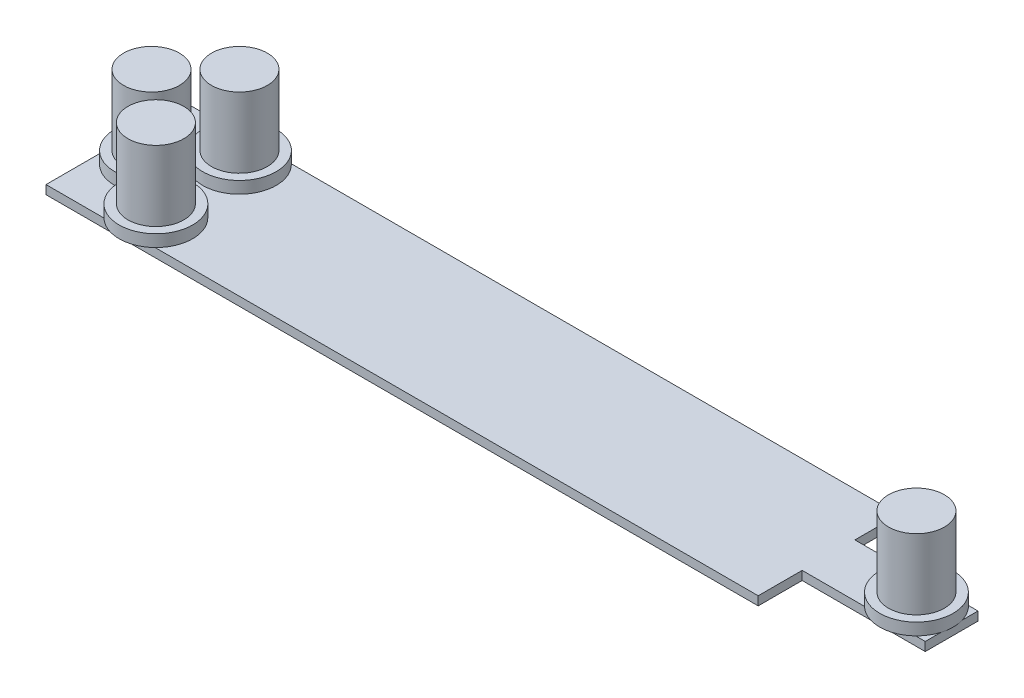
ISO-10303-21;
HEADER;
FILE_DESCRIPTION(('STEP AP214'),'2;1');
FILE_NAME('part.step','',(''),(''),'','','');
FILE_SCHEMA(('AUTOMOTIVE_DESIGN { 1 0 10303 214 1 1 1 1 }'));
ENDSEC;
DATA;
#1=APPLICATION_CONTEXT('core data for automotive mechanical design processes');
#2=APPLICATION_PROTOCOL_DEFINITION('international standard','automotive_design',2000,#1);
#3=PRODUCT_CONTEXT('',#1,'mechanical');
#4=PRODUCT('Part','Part','',(#3));
#5=PRODUCT_RELATED_PRODUCT_CATEGORY('part','',(#4));
#6=PRODUCT_DEFINITION_FORMATION('','',#4);
#7=PRODUCT_DEFINITION_CONTEXT('part definition',#1,'design');
#8=PRODUCT_DEFINITION('design','',#6,#7);
#9=PRODUCT_DEFINITION_SHAPE('','',#8);
#10=(LENGTH_UNIT() NAMED_UNIT(*) SI_UNIT(.MILLI.,.METRE.));
#11=(NAMED_UNIT(*) PLANE_ANGLE_UNIT() SI_UNIT($,.RADIAN.));
#12=(NAMED_UNIT(*) SI_UNIT($,.STERADIAN.) SOLID_ANGLE_UNIT());
#13=UNCERTAINTY_MEASURE_WITH_UNIT(LENGTH_MEASURE(1.E-05),#10,'distance_accuracy_value','');
#14=(GEOMETRIC_REPRESENTATION_CONTEXT(3) GLOBAL_UNCERTAINTY_ASSIGNED_CONTEXT((#13)) GLOBAL_UNIT_ASSIGNED_CONTEXT((#10,
#11,#12)) REPRESENTATION_CONTEXT('',''));
#15=CARTESIAN_POINT('',(0.,0.,0.));
#16=DIRECTION('',(0.,0.,1.));
#17=DIRECTION('',(1.,0.,0.));
#18=AXIS2_PLACEMENT_3D('',#15,#16,#17);
#19=CARTESIAN_POINT('',(43.5,2.36,0.));
#20=DIRECTION('',(0.,1.,0.));
#21=DIRECTION('',(0.,0.,1.));
#22=AXIS2_PLACEMENT_3D('',#19,#20,#21);
#23=PLANE('',#22);
#24=CARTESIAN_POINT('',(43.5,2.36,0.));
#25=DIRECTION('',(0.,1.,0.));
#26=DIRECTION('',(0.,0.,1.));
#27=AXIS2_PLACEMENT_3D('',#24,#25,#26);
#28=CIRCLE('',#27,4.18);
#29=CARTESIAN_POINT('',(43.5,2.36,4.18));
#30=VERTEX_POINT('',#29);
#31=EDGE_CURVE('E220',#30,#30,#28,.T.);
#32=ORIENTED_EDGE('',*,*,#31,.T.);
#33=EDGE_LOOP('',(#32));
#34=FACE_BOUND('',#33,.T.);
#35=CARTESIAN_POINT('',(43.5,2.36,0.));
#36=DIRECTION('',(0.,1.,0.));
#37=DIRECTION('',(0.,0.,1.));
#38=AXIS2_PLACEMENT_3D('',#35,#36,#37);
#39=CIRCLE('',#38,3.18);
#40=CARTESIAN_POINT('',(43.5,2.36,3.18));
#41=VERTEX_POINT('',#40);
#42=EDGE_CURVE('E637',#41,#41,#39,.T.);
#43=ORIENTED_EDGE('',*,*,#42,.F.);
#44=EDGE_LOOP('',(#43));
#45=FACE_BOUND('',#44,.T.);
#46=ADVANCED_FACE('F33',(#34,#45),#23,.T.);
#47=CARTESIAN_POINT('',(-38.,2.36,5.));
#48=DIRECTION('',(0.,1.,0.));
#49=DIRECTION('',(0.,0.,1.));
#50=AXIS2_PLACEMENT_3D('',#47,#48,#49);
#51=PLANE('',#50);
#52=CARTESIAN_POINT('',(-38.,2.36,5.));
#53=DIRECTION('',(0.,1.,0.));
#54=DIRECTION('',(0.,0.,1.));
#55=AXIS2_PLACEMENT_3D('',#52,#53,#54);
#56=CIRCLE('',#55,4.18);
#57=CARTESIAN_POINT('',(-38.,2.36,9.18));
#58=VERTEX_POINT('',#57);
#59=EDGE_CURVE('E234',#58,#58,#56,.T.);
#60=ORIENTED_EDGE('',*,*,#59,.T.);
#61=EDGE_LOOP('',(#60));
#62=FACE_BOUND('',#61,.T.);
#63=CARTESIAN_POINT('',(-38.,2.36,5.));
#64=DIRECTION('',(0.,1.,0.));
#65=DIRECTION('',(0.,0.,1.));
#66=AXIS2_PLACEMENT_3D('',#63,#64,#65);
#67=CIRCLE('',#66,3.18);
#68=CARTESIAN_POINT('',(-38.,2.36,8.18));
#69=VERTEX_POINT('',#68);
#70=EDGE_CURVE('E636',#69,#69,#67,.T.);
#71=ORIENTED_EDGE('',*,*,#70,.F.);
#72=EDGE_LOOP('',(#71));
#73=FACE_BOUND('',#72,.T.);
#74=ADVANCED_FACE('F403',(#62,#73),#51,.T.);
#75=CARTESIAN_POINT('',(-43.5,2.36,0.));
#76=DIRECTION('',(0.,1.,0.));
#77=DIRECTION('',(0.,0.,1.));
#78=AXIS2_PLACEMENT_3D('',#75,#76,#77);
#79=PLANE('',#78);
#80=CARTESIAN_POINT('',(-43.5,2.36,0.));
#81=DIRECTION('',(0.,1.,0.));
#82=DIRECTION('',(0.,0.,1.));
#83=AXIS2_PLACEMENT_3D('',#80,#81,#82);
#84=CIRCLE('',#83,3.18);
#85=CARTESIAN_POINT('',(-40.4514752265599,2.36,0.904929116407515));
#86=VERTEX_POINT('',#85);
#87=CARTESIAN_POINT('',(-40.358666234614,2.36,-0.494390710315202));
#88=VERTEX_POINT('',#87);
#89=EDGE_CURVE('E208',#86,#88,#84,.T.);
#90=ORIENTED_EDGE('',*,*,#89,.F.);
#91=DIRECTION('',(0.547787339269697,0.,-0.8366176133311));
#92=VECTOR('',#91,1.);
#93=CARTESIAN_POINT('',(-42.519515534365,2.36,4.06337916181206));
#94=LINE('',#93,#92);
#95=CARTESIAN_POINT('',(-40.3182491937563,2.36,0.701457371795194));
#96=VERTEX_POINT('',#95);
#97=EDGE_CURVE('E184',#86,#96,#94,.T.);
#98=ORIENTED_EDGE('',*,*,#97,.T.);
#99=DIRECTION('',(0.,0.,-1.));
#100=VECTOR('',#99,1.);
#101=CARTESIAN_POINT('',(-40.3182491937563,2.36,0.701457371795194));
#102=LINE('',#101,#100);
#103=CARTESIAN_POINT('',(-40.3182491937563,2.36,-0.44348631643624));
#104=VERTEX_POINT('',#103);
#105=EDGE_CURVE('E183',#96,#104,#102,.T.);
#106=ORIENTED_EDGE('',*,*,#105,.T.);
#107=DIRECTION('',(-0.621815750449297,0.,-0.783163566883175));
#108=VECTOR('',#107,1.);
#109=CARTESIAN_POINT('',(-40.3182491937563,2.36,-0.44348631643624));
#110=LINE('',#109,#108);
#111=EDGE_CURVE('E251',#104,#88,#110,.T.);
#112=ORIENTED_EDGE('',*,*,#111,.T.);
#113=EDGE_LOOP('',(#90,#98,#106,#112));
#114=FACE_BOUND('',#113,.T.);
#115=ADVANCED_FACE('F409',(#114),#79,.T.);
#116=CARTESIAN_POINT('',(-38.5,2.36,-5.));
#117=DIRECTION('',(0.,1.,0.));
#118=DIRECTION('',(0.,0.,1.));
#119=AXIS2_PLACEMENT_3D('',#116,#117,#118);
#120=PLANE('',#119);
#121=CARTESIAN_POINT('',(-38.5,2.36,-5.));
#122=DIRECTION('',(0.,1.,0.));
#123=DIRECTION('',(0.,0.,1.));
#124=AXIS2_PLACEMENT_3D('',#121,#122,#123);
#125=CIRCLE('',#124,3.18);
#126=CARTESIAN_POINT('',(-38.5,2.36,-1.82));
#127=VERTEX_POINT('',#126);
#128=EDGE_CURVE('E195',#127,#127,#125,.T.);
#129=ORIENTED_EDGE('',*,*,#128,.F.);
#130=EDGE_LOOP('',(#129));
#131=FACE_BOUND('',#130,.T.);
#132=CARTESIAN_POINT('',(-38.5,2.36,-5.));
#133=DIRECTION('',(0.,1.,0.));
#134=DIRECTION('',(0.,0.,1.));
#135=AXIS2_PLACEMENT_3D('',#132,#133,#134);
#136=CIRCLE('',#135,4.18);
#137=CARTESIAN_POINT('',(-40.6533140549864,2.36,-1.41731405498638));
#138=VERTEX_POINT('',#137);
#139=CARTESIAN_POINT('',(-42.0826859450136,2.36,-2.84668594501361));
#140=VERTEX_POINT('',#139);
#141=EDGE_CURVE('E245',#138,#140,#136,.T.);
#142=ORIENTED_EDGE('',*,*,#141,.T.);
#143=EDGE_CURVE('E654',#138,#140,#84,.T.);
#144=ORIENTED_EDGE('',*,*,#143,.F.);
#145=EDGE_LOOP('',(#142,#144));
#146=FACE_BOUND('',#145,.T.);
#147=ADVANCED_FACE('F489',(#131,#146),#120,.T.);
#148=CARTESIAN_POINT('',(0.,1.,0.));
#149=DIRECTION('',(0.,1.,0.));
#150=DIRECTION('',(0.,0.,1.));
#151=AXIS2_PLACEMENT_3D('',#148,#149,#150);
#152=PLANE('',#151);
#153=DIRECTION('',(1.,0.,0.));
#154=VECTOR('',#153,1.);
#155=CARTESIAN_POINT('',(47.5,1.,2.99999999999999));
#156=LINE('',#155,#154);
#157=CARTESIAN_POINT('',(33.5,1.,2.99999999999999));
#158=VERTEX_POINT('',#157);
#159=CARTESIAN_POINT('',(40.5892612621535,1.,2.99999999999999));
#160=VERTEX_POINT('',#159);
#161=EDGE_CURVE('E288',#158,#160,#156,.T.);
#162=ORIENTED_EDGE('',*,*,#161,.T.);
#163=CARTESIAN_POINT('',(43.5,1.,0.));
#164=DIRECTION('',(0.,1.,0.));
#165=DIRECTION('',(0.,0.,1.));
#166=AXIS2_PLACEMENT_3D('',#163,#164,#165);
#167=CIRCLE('',#166,4.18);
#168=CARTESIAN_POINT('',(40.5892612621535,1.,-3.00000000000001));
#169=VERTEX_POINT('',#168);
#170=EDGE_CURVE('E441',#169,#160,#167,.T.);
#171=ORIENTED_EDGE('',*,*,#170,.F.);
#172=DIRECTION('',(-1.,0.,0.));
#173=VECTOR('',#172,1.);
#174=CARTESIAN_POINT('',(47.5,1.,-3.00000000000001));
#175=LINE('',#174,#173);
#176=CARTESIAN_POINT('',(33.5,1.,-3.00000000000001));
#177=VERTEX_POINT('',#176);
#178=EDGE_CURVE('E295',#169,#177,#175,.T.);
#179=ORIENTED_EDGE('',*,*,#178,.T.);
#180=DIRECTION('',(0.,0.,-1.));
#181=VECTOR('',#180,1.);
#182=CARTESIAN_POINT('',(33.5,1.,-3.00000000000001));
#183=LINE('',#182,#181);
#184=CARTESIAN_POINT('',(33.5,1.,-8.00000000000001));
#185=VERTEX_POINT('',#184);
#186=EDGE_CURVE('E299',#177,#185,#183,.T.);
#187=ORIENTED_EDGE('',*,*,#186,.T.);
#188=DIRECTION('',(-1.,0.,0.));
#189=VECTOR('',#188,1.);
#190=CARTESIAN_POINT('',(33.5,1.,-8.00000000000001));
#191=LINE('',#190,#189);
#192=CARTESIAN_POINT('',(-35.5892612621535,1.,-7.99999999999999));
#193=VERTEX_POINT('',#192);
#194=EDGE_CURVE('E303',#185,#193,#191,.T.);
#195=ORIENTED_EDGE('',*,*,#194,.T.);
#196=CARTESIAN_POINT('',(-38.5,1.,-5.));
#197=DIRECTION('',(0.,1.,0.));
#198=DIRECTION('',(0.,0.,1.));
#199=AXIS2_PLACEMENT_3D('',#196,#197,#198);
#200=CIRCLE('',#199,4.18);
#201=CARTESIAN_POINT('',(-41.4107387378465,1.,-8.));
#202=VERTEX_POINT('',#201);
#203=EDGE_CURVE('E11',#193,#202,#200,.F.);
#204=ORIENTED_EDGE('',*,*,#203,.T.);
#205=CARTESIAN_POINT('',(-47.5,1.,-8.));
#206=VERTEX_POINT('',#205);
#207=EDGE_CURVE('E302',#202,#206,#191,.T.);
#208=ORIENTED_EDGE('',*,*,#207,.T.);
#209=DIRECTION('',(0.,0.,1.));
#210=VECTOR('',#209,1.);
#211=CARTESIAN_POINT('',(-47.5,1.,8.));
#212=LINE('',#211,#210);
#213=CARTESIAN_POINT('',(-47.5,1.,-1.21342490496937));
#214=VERTEX_POINT('',#213);
#215=EDGE_CURVE('E275',#206,#214,#212,.T.);
#216=ORIENTED_EDGE('',*,*,#215,.T.);
#217=CARTESIAN_POINT('',(-43.5,1.,0.));
#218=DIRECTION('',(0.,1.,0.));
#219=DIRECTION('',(0.,0.,1.));
#220=AXIS2_PLACEMENT_3D('',#217,#218,#219);
#221=CIRCLE('',#220,4.18);
#222=CARTESIAN_POINT('',(-43.2803801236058,1.,-4.17422652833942));
#223=VERTEX_POINT('',#222);
#224=EDGE_CURVE('E254',#223,#214,#221,.T.);
#225=ORIENTED_EDGE('',*,*,#224,.F.);
#226=DIRECTION('',(-0.621815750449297,0.,-0.783163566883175));
#227=VECTOR('',#226,1.);
#228=CARTESIAN_POINT('',(-40.3182491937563,1.,-0.44348631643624));
#229=LINE('',#228,#227);
#230=CARTESIAN_POINT('',(-40.3182491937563,1.,-0.44348631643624));
#231=VERTEX_POINT('',#230);
#232=EDGE_CURVE('E247',#231,#223,#229,.T.);
#233=ORIENTED_EDGE('',*,*,#232,.F.);
#234=DIRECTION('',(0.,0.,-1.));
#235=VECTOR('',#234,1.);
#236=CARTESIAN_POINT('',(-40.3182491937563,1.,0.701457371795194));
#237=LINE('',#236,#235);
#238=CARTESIAN_POINT('',(-40.3182491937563,1.,0.701457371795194));
#239=VERTEX_POINT('',#238);
#240=EDGE_CURVE('E259',#239,#231,#237,.T.);
#241=ORIENTED_EDGE('',*,*,#240,.F.);
#242=DIRECTION('',(0.547787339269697,0.,-0.8366176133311));
#243=VECTOR('',#242,1.);
#244=CARTESIAN_POINT('',(-42.519515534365,1.,4.06337916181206));
#245=LINE('',#244,#243);
#246=CARTESIAN_POINT('',(-42.519515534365,1.,4.06337916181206));
#247=VERTEX_POINT('',#246);
#248=EDGE_CURVE('E257',#247,#239,#245,.T.);
#249=ORIENTED_EDGE('',*,*,#248,.F.);
#250=CARTESIAN_POINT('',(-47.5,1.,1.21342490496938));
#251=VERTEX_POINT('',#250);
#252=EDGE_CURVE('E41',#251,#247,#221,.T.);
#253=ORIENTED_EDGE('',*,*,#252,.F.);
#254=CARTESIAN_POINT('',(-47.5,1.,8.));
#255=VERTEX_POINT('',#254);
#256=EDGE_CURVE('E280',#251,#255,#212,.T.);
#257=ORIENTED_EDGE('',*,*,#256,.T.);
#258=DIRECTION('',(1.,0.,0.));
#259=VECTOR('',#258,1.);
#260=CARTESIAN_POINT('',(33.5,1.,7.99999999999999));
#261=LINE('',#260,#259);
#262=CARTESIAN_POINT('',(-40.9107387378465,1.,8.));
#263=VERTEX_POINT('',#262);
#264=EDGE_CURVE('E281',#255,#263,#261,.T.);
#265=ORIENTED_EDGE('',*,*,#264,.T.);
#266=CARTESIAN_POINT('',(-38.,1.,5.));
#267=DIRECTION('',(0.,1.,0.));
#268=DIRECTION('',(0.,0.,1.));
#269=AXIS2_PLACEMENT_3D('',#266,#267,#268);
#270=CIRCLE('',#269,4.18);
#271=CARTESIAN_POINT('',(-35.0892612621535,1.,8.));
#272=VERTEX_POINT('',#271);
#273=EDGE_CURVE('E238',#272,#263,#270,.T.);
#274=ORIENTED_EDGE('',*,*,#273,.F.);
#275=CARTESIAN_POINT('',(33.5,1.,7.99999999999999));
#276=VERTEX_POINT('',#275);
#277=EDGE_CURVE('E278',#272,#276,#261,.T.);
#278=ORIENTED_EDGE('',*,*,#277,.T.);
#279=DIRECTION('',(0.,0.,-1.));
#280=VECTOR('',#279,1.);
#281=CARTESIAN_POINT('',(33.5,1.,2.99999999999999));
#282=LINE('',#281,#280);
#283=EDGE_CURVE('E284',#276,#158,#282,.T.);
#284=ORIENTED_EDGE('',*,*,#283,.T.);
#285=EDGE_LOOP('',(#162,#171,#179,#187,#195,#204,#208,#216,#225,#233,#241,#249,#253,#257,#265,
#274,#278,#284));
#286=FACE_BOUND('',#285,.T.);
#287=ADVANCED_FACE('F360',(#286),#152,.T.);
#288=CARTESIAN_POINT('',(47.5,1.,-3.00000000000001));
#289=VERTEX_POINT('',#288);
#290=CARTESIAN_POINT('',(46.4107387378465,1.,-3.00000000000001));
#291=VERTEX_POINT('',#290);
#292=EDGE_CURVE('E296',#289,#291,#175,.T.);
#293=ORIENTED_EDGE('',*,*,#292,.T.);
#294=CARTESIAN_POINT('',(47.5,1.,-1.21342490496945));
#295=VERTEX_POINT('',#294);
#296=EDGE_CURVE('E446',#295,#291,#167,.T.);
#297=ORIENTED_EDGE('',*,*,#296,.F.);
#298=DIRECTION('',(0.,0.,-1.));
#299=VECTOR('',#298,1.);
#300=CARTESIAN_POINT('',(47.5,1.,2.99999999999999));
#301=LINE('',#300,#299);
#302=EDGE_CURVE('E291',#295,#289,#301,.T.);
#303=ORIENTED_EDGE('',*,*,#302,.T.);
#304=EDGE_LOOP('',(#293,#297,#303));
#305=FACE_BOUND('',#304,.T.);
#306=ADVANCED_FACE('F449',(#305),#152,.T.);
#307=CARTESIAN_POINT('',(47.5,1.,2.99999999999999));
#308=VERTEX_POINT('',#307);
#309=CARTESIAN_POINT('',(47.5,1.,1.21342490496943));
#310=VERTEX_POINT('',#309);
#311=EDGE_CURVE('E292',#308,#310,#301,.T.);
#312=ORIENTED_EDGE('',*,*,#311,.T.);
#313=CARTESIAN_POINT('',(46.4107387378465,1.,2.99999999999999));
#314=VERTEX_POINT('',#313);
#315=EDGE_CURVE('E224',#314,#310,#167,.T.);
#316=ORIENTED_EDGE('',*,*,#315,.F.);
#317=EDGE_CURVE('E287',#314,#308,#156,.T.);
#318=ORIENTED_EDGE('',*,*,#317,.T.);
#319=EDGE_LOOP('',(#312,#316,#318));
#320=FACE_BOUND('',#319,.T.);
#321=ADVANCED_FACE('F436',(#320),#152,.T.);
#322=CARTESIAN_POINT('',(-47.5,1.,8.));
#323=DIRECTION('',(1.,0.,0.));
#324=DIRECTION('',(0.,0.,-1.));
#325=AXIS2_PLACEMENT_3D('',#322,#323,#324);
#326=PLANE('',#325);
#327=DIRECTION('',(0.,0.,1.));
#328=VECTOR('',#327,1.);
#329=CARTESIAN_POINT('',(-47.5,0.,8.));
#330=LINE('',#329,#328);
#331=CARTESIAN_POINT('',(-47.5,0.,-8.));
#332=VERTEX_POINT('',#331);
#333=CARTESIAN_POINT('',(-47.5,0.,8.));
#334=VERTEX_POINT('',#333);
#335=EDGE_CURVE('E274',#332,#334,#330,.T.);
#336=ORIENTED_EDGE('',*,*,#335,.T.);
#337=DIRECTION('',(0.,-1.,0.));
#338=VECTOR('',#337,1.);
#339=CARTESIAN_POINT('',(-47.5,1.,8.));
#340=LINE('',#339,#338);
#341=EDGE_CURVE('E343',#255,#334,#340,.T.);
#342=ORIENTED_EDGE('',*,*,#341,.F.);
#343=ORIENTED_EDGE('',*,*,#256,.F.);
#344=EDGE_CURVE('E279',#214,#251,#212,.T.);
#345=ORIENTED_EDGE('',*,*,#344,.F.);
#346=ORIENTED_EDGE('',*,*,#215,.F.);
#347=DIRECTION('',(0.,-1.,0.));
#348=VECTOR('',#347,1.);
#349=CARTESIAN_POINT('',(-47.5,1.,-8.));
#350=LINE('',#349,#348);
#351=EDGE_CURVE('E306',#206,#332,#350,.T.);
#352=ORIENTED_EDGE('',*,*,#351,.T.);
#353=EDGE_LOOP('',(#336,#342,#343,#345,#346,#352));
#354=FACE_BOUND('',#353,.T.);
#355=ADVANCED_FACE('F35',(#354),#326,.F.);
#356=CARTESIAN_POINT('',(33.5,1.,7.99999999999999));
#357=DIRECTION('',(0.,0.,-1.));
#358=DIRECTION('',(-1.,0.,0.));
#359=AXIS2_PLACEMENT_3D('',#356,#357,#358);
#360=PLANE('',#359);
#361=DIRECTION('',(1.,0.,0.));
#362=VECTOR('',#361,1.);
#363=CARTESIAN_POINT('',(33.5,0.,7.99999999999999));
#364=LINE('',#363,#362);
#365=CARTESIAN_POINT('',(33.5,0.,7.99999999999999));
#366=VERTEX_POINT('',#365);
#367=EDGE_CURVE('E310',#334,#366,#364,.T.);
#368=ORIENTED_EDGE('',*,*,#367,.T.);
#369=DIRECTION('',(0.,-1.,0.));
#370=VECTOR('',#369,1.);
#371=CARTESIAN_POINT('',(33.5,1.,7.99999999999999));
#372=LINE('',#371,#370);
#373=EDGE_CURVE('E341',#276,#366,#372,.T.);
#374=ORIENTED_EDGE('',*,*,#373,.F.);
#375=ORIENTED_EDGE('',*,*,#277,.F.);
#376=EDGE_CURVE('E285',#263,#272,#261,.T.);
#377=ORIENTED_EDGE('',*,*,#376,.F.);
#378=ORIENTED_EDGE('',*,*,#264,.F.);
#379=ORIENTED_EDGE('',*,*,#341,.T.);
#380=EDGE_LOOP('',(#368,#374,#375,#377,#378,#379));
#381=FACE_BOUND('',#380,.T.);
#382=ADVANCED_FACE('F363',(#381),#360,.F.);
#383=CARTESIAN_POINT('',(33.5,1.,2.99999999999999));
#384=DIRECTION('',(-1.,0.,0.));
#385=DIRECTION('',(0.,0.,1.));
#386=AXIS2_PLACEMENT_3D('',#383,#384,#385);
#387=PLANE('',#386);
#388=DIRECTION('',(0.,0.,-1.));
#389=VECTOR('',#388,1.);
#390=CARTESIAN_POINT('',(33.5,0.,2.99999999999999));
#391=LINE('',#390,#389);
#392=CARTESIAN_POINT('',(33.5,0.,2.99999999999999));
#393=VERTEX_POINT('',#392);
#394=EDGE_CURVE('E312',#366,#393,#391,.T.);
#395=ORIENTED_EDGE('',*,*,#394,.T.);
#396=DIRECTION('',(0.,-1.,0.));
#397=VECTOR('',#396,1.);
#398=CARTESIAN_POINT('',(33.5,1.,2.99999999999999));
#399=LINE('',#398,#397);
#400=EDGE_CURVE('E338',#158,#393,#399,.T.);
#401=ORIENTED_EDGE('',*,*,#400,.F.);
#402=ORIENTED_EDGE('',*,*,#283,.F.);
#403=ORIENTED_EDGE('',*,*,#373,.T.);
#404=EDGE_LOOP('',(#395,#401,#402,#403));
#405=FACE_BOUND('',#404,.T.);
#406=ADVANCED_FACE('F376',(#405),#387,.F.);
#407=CARTESIAN_POINT('',(47.5,1.,2.99999999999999));
#408=DIRECTION('',(0.,0.,-1.));
#409=DIRECTION('',(-1.,0.,0.));
#410=AXIS2_PLACEMENT_3D('',#407,#408,#409);
#411=PLANE('',#410);
#412=DIRECTION('',(1.,0.,0.));
#413=VECTOR('',#412,1.);
#414=CARTESIAN_POINT('',(47.5,0.,2.99999999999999));
#415=LINE('',#414,#413);
#416=CARTESIAN_POINT('',(47.5,0.,2.99999999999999));
#417=VERTEX_POINT('',#416);
#418=EDGE_CURVE('E314',#393,#417,#415,.T.);
#419=ORIENTED_EDGE('',*,*,#418,.T.);
#420=DIRECTION('',(0.,-1.,0.));
#421=VECTOR('',#420,1.);
#422=CARTESIAN_POINT('',(47.5,1.,2.99999999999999));
#423=LINE('',#422,#421);
#424=EDGE_CURVE('E335',#308,#417,#423,.T.);
#425=ORIENTED_EDGE('',*,*,#424,.F.);
#426=ORIENTED_EDGE('',*,*,#317,.F.);
#427=DIRECTION('',(1.,0.,0.));
#428=VECTOR('',#427,1.);
#429=CARTESIAN_POINT('',(47.5,1.,2.99999999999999));
#430=LINE('',#429,#428);
#431=EDGE_CURVE('E230',#160,#314,#430,.T.);
#432=ORIENTED_EDGE('',*,*,#431,.F.);
#433=ORIENTED_EDGE('',*,*,#161,.F.);
#434=ORIENTED_EDGE('',*,*,#400,.T.);
#435=EDGE_LOOP('',(#419,#425,#426,#432,#433,#434));
#436=FACE_BOUND('',#435,.T.);
#437=ADVANCED_FACE('F440',(#436),#411,.F.);
#438=CARTESIAN_POINT('',(47.5,1.,2.99999999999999));
#439=DIRECTION('',(-1.,0.,0.));
#440=DIRECTION('',(0.,0.,1.));
#441=AXIS2_PLACEMENT_3D('',#438,#439,#440);
#442=PLANE('',#441);
#443=DIRECTION('',(0.,0.,-1.));
#444=VECTOR('',#443,1.);
#445=CARTESIAN_POINT('',(47.5,0.,2.99999999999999));
#446=LINE('',#445,#444);
#447=CARTESIAN_POINT('',(47.5,0.,-3.00000000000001));
#448=VERTEX_POINT('',#447);
#449=EDGE_CURVE('E316',#417,#448,#446,.T.);
#450=ORIENTED_EDGE('',*,*,#449,.T.);
#451=DIRECTION('',(0.,-1.,0.));
#452=VECTOR('',#451,1.);
#453=CARTESIAN_POINT('',(47.5,1.,-3.00000000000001));
#454=LINE('',#453,#452);
#455=EDGE_CURVE('E332',#289,#448,#454,.T.);
#456=ORIENTED_EDGE('',*,*,#455,.F.);
#457=ORIENTED_EDGE('',*,*,#302,.F.);
#458=DIRECTION('',(0.,0.,-1.));
#459=VECTOR('',#458,1.);
#460=CARTESIAN_POINT('',(47.5,1.,2.99999999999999));
#461=LINE('',#460,#459);
#462=EDGE_CURVE('E223',#310,#295,#461,.T.);
#463=ORIENTED_EDGE('',*,*,#462,.F.);
#464=ORIENTED_EDGE('',*,*,#311,.F.);
#465=ORIENTED_EDGE('',*,*,#424,.T.);
#466=EDGE_LOOP('',(#450,#456,#457,#463,#464,#465));
#467=FACE_BOUND('',#466,.T.);
#468=ADVANCED_FACE('F453',(#467),#442,.F.);
#469=CARTESIAN_POINT('',(47.5,1.,-3.00000000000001));
#470=DIRECTION('',(0.,0.,1.));
#471=DIRECTION('',(1.,0.,0.));
#472=AXIS2_PLACEMENT_3D('',#469,#470,#471);
#473=PLANE('',#472);
#474=DIRECTION('',(-1.,0.,0.));
#475=VECTOR('',#474,1.);
#476=CARTESIAN_POINT('',(47.5,0.,-3.00000000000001));
#477=LINE('',#476,#475);
#478=CARTESIAN_POINT('',(33.5,0.,-3.00000000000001));
#479=VERTEX_POINT('',#478);
#480=EDGE_CURVE('E318',#448,#479,#477,.T.);
#481=ORIENTED_EDGE('',*,*,#480,.T.);
#482=DIRECTION('',(0.,-1.,0.));
#483=VECTOR('',#482,1.);
#484=CARTESIAN_POINT('',(33.5,1.,-3.00000000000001));
#485=LINE('',#484,#483);
#486=EDGE_CURVE('E329',#177,#479,#485,.T.);
#487=ORIENTED_EDGE('',*,*,#486,.F.);
#488=ORIENTED_EDGE('',*,*,#178,.F.);
#489=EDGE_CURVE('E300',#291,#169,#175,.T.);
#490=ORIENTED_EDGE('',*,*,#489,.F.);
#491=ORIENTED_EDGE('',*,*,#292,.F.);
#492=ORIENTED_EDGE('',*,*,#455,.T.);
#493=EDGE_LOOP('',(#481,#487,#488,#490,#491,#492));
#494=FACE_BOUND('',#493,.T.);
#495=ADVANCED_FACE('F672',(#494),#473,.F.);
#496=CARTESIAN_POINT('',(33.5,1.,-3.00000000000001));
#497=DIRECTION('',(-1.,0.,0.));
#498=DIRECTION('',(0.,0.,1.));
#499=AXIS2_PLACEMENT_3D('',#496,#497,#498);
#500=PLANE('',#499);
#501=DIRECTION('',(0.,0.,-1.));
#502=VECTOR('',#501,1.);
#503=CARTESIAN_POINT('',(33.5,0.,-3.00000000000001));
#504=LINE('',#503,#502);
#505=CARTESIAN_POINT('',(33.5,0.,-8.00000000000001));
#506=VERTEX_POINT('',#505);
#507=EDGE_CURVE('E320',#479,#506,#504,.T.);
#508=ORIENTED_EDGE('',*,*,#507,.T.);
#509=DIRECTION('',(0.,-1.,0.));
#510=VECTOR('',#509,1.);
#511=CARTESIAN_POINT('',(33.5,1.,-8.00000000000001));
#512=LINE('',#511,#510);
#513=EDGE_CURVE('E326',#185,#506,#512,.T.);
#514=ORIENTED_EDGE('',*,*,#513,.F.);
#515=ORIENTED_EDGE('',*,*,#186,.F.);
#516=ORIENTED_EDGE('',*,*,#486,.T.);
#517=EDGE_LOOP('',(#508,#514,#515,#516));
#518=FACE_BOUND('',#517,.T.);
#519=ADVANCED_FACE('F667',(#518),#500,.F.);
#520=CARTESIAN_POINT('',(33.5,1.,-8.00000000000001));
#521=DIRECTION('',(0.,0.,1.));
#522=DIRECTION('',(1.,0.,0.));
#523=AXIS2_PLACEMENT_3D('',#520,#521,#522);
#524=PLANE('',#523);
#525=DIRECTION('',(-1.,0.,0.));
#526=VECTOR('',#525,1.);
#527=CARTESIAN_POINT('',(33.5,0.,-8.00000000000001));
#528=LINE('',#527,#526);
#529=EDGE_CURVE('E322',#506,#332,#528,.T.);
#530=ORIENTED_EDGE('',*,*,#529,.T.);
#531=ORIENTED_EDGE('',*,*,#351,.F.);
#532=ORIENTED_EDGE('',*,*,#207,.F.);
#533=EDGE_CURVE('E307',#193,#202,#191,.T.);
#534=ORIENTED_EDGE('',*,*,#533,.F.);
#535=ORIENTED_EDGE('',*,*,#194,.F.);
#536=ORIENTED_EDGE('',*,*,#513,.T.);
#537=EDGE_LOOP('',(#530,#531,#532,#534,#535,#536));
#538=FACE_BOUND('',#537,.T.);
#539=ADVANCED_FACE('F662',(#538),#524,.F.);
#540=CARTESIAN_POINT('',(0.,0.,0.));
#541=DIRECTION('',(0.,1.,0.));
#542=DIRECTION('',(0.,0.,1.));
#543=AXIS2_PLACEMENT_3D('',#540,#541,#542);
#544=PLANE('',#543);
#545=ORIENTED_EDGE('',*,*,#335,.F.);
#546=ORIENTED_EDGE('',*,*,#529,.F.);
#547=ORIENTED_EDGE('',*,*,#507,.F.);
#548=ORIENTED_EDGE('',*,*,#480,.F.);
#549=ORIENTED_EDGE('',*,*,#449,.F.);
#550=ORIENTED_EDGE('',*,*,#418,.F.);
#551=ORIENTED_EDGE('',*,*,#394,.F.);
#552=ORIENTED_EDGE('',*,*,#367,.F.);
#553=EDGE_LOOP('',(#545,#546,#547,#548,#549,#550,#551,#552));
#554=FACE_BOUND('',#553,.T.);
#555=ADVANCED_FACE('F369',(#554),#544,.F.);
#556=CARTESIAN_POINT('',(-43.5,1.,0.));
#557=DIRECTION('',(0.,1.,0.));
#558=DIRECTION('',(0.,0.,1.));
#559=AXIS2_PLACEMENT_3D('',#556,#557,#558);
#560=PLANE('',#559);
#561=EDGE_CURVE('E244',#214,#251,#221,.T.);
#562=ORIENTED_EDGE('',*,*,#561,.F.);
#563=ORIENTED_EDGE('',*,*,#344,.T.);
#564=EDGE_LOOP('',(#562,#563));
#565=FACE_BOUND('',#564,.T.);
#566=ADVANCED_FACE('F355',(#565),#560,.F.);
#567=CARTESIAN_POINT('',(-43.5,2.36,0.));
#568=DIRECTION('',(0.,-1.,0.));
#569=DIRECTION('',(0.,0.,-1.));
#570=AXIS2_PLACEMENT_3D('',#567,#568,#569);
#571=CYLINDRICAL_SURFACE('',#570,4.18);
#572=ORIENTED_EDGE('',*,*,#224,.T.);
#573=ORIENTED_EDGE('',*,*,#561,.T.);
#574=ORIENTED_EDGE('',*,*,#252,.T.);
#575=DIRECTION('',(0.,-1.,0.));
#576=VECTOR('',#575,1.);
#577=CARTESIAN_POINT('',(-42.519515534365,2.36,4.06337916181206));
#578=LINE('',#577,#576);
#579=CARTESIAN_POINT('',(-42.519515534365,2.36,4.06337916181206));
#580=VERTEX_POINT('',#579);
#581=EDGE_CURVE('E272',#580,#247,#578,.T.);
#582=ORIENTED_EDGE('',*,*,#581,.F.);
#583=CARTESIAN_POINT('',(-43.5,2.36,0.));
#584=DIRECTION('',(0.,1.,0.));
#585=DIRECTION('',(0.,0.,1.));
#586=AXIS2_PLACEMENT_3D('',#583,#584,#585);
#587=CIRCLE('',#586,4.18);
#588=CARTESIAN_POINT('',(-43.2803801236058,2.36,-4.17422652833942));
#589=VERTEX_POINT('',#588);
#590=EDGE_CURVE('E179',#589,#580,#587,.T.);
#591=ORIENTED_EDGE('',*,*,#590,.F.);
#592=DIRECTION('',(0.,-1.,0.));
#593=VECTOR('',#592,1.);
#594=CARTESIAN_POINT('',(-43.2803801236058,2.36,-4.17422652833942));
#595=LINE('',#594,#593);
#596=EDGE_CURVE('E253',#589,#223,#595,.T.);
#597=ORIENTED_EDGE('',*,*,#596,.T.);
#598=EDGE_LOOP('',(#572,#573,#574,#582,#591,#597));
#599=FACE_BOUND('',#598,.T.);
#600=ADVANCED_FACE('F352',(#599),#571,.T.);
#601=CARTESIAN_POINT('',(-42.519515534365,2.36,4.06337916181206));
#602=DIRECTION('',(-0.8366176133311,0.,-0.547787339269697));
#603=DIRECTION('',(-0.547787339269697,0.,0.8366176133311));
#604=AXIS2_PLACEMENT_3D('',#601,#602,#603);
#605=PLANE('',#604);
#606=ORIENTED_EDGE('',*,*,#248,.T.);
#607=DIRECTION('',(0.,-1.,0.));
#608=VECTOR('',#607,1.);
#609=CARTESIAN_POINT('',(-40.3182491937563,2.36,0.701457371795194));
#610=LINE('',#609,#608);
#611=EDGE_CURVE('E269',#96,#239,#610,.T.);
#612=ORIENTED_EDGE('',*,*,#611,.F.);
#613=ORIENTED_EDGE('',*,*,#97,.F.);
#614=CARTESIAN_POINT('',(-41.4515855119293,2.36,2.43236471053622));
#615=VERTEX_POINT('',#614);
#616=EDGE_CURVE('E186',#615,#86,#94,.T.);
#617=ORIENTED_EDGE('',*,*,#616,.F.);
#618=EDGE_CURVE('E175',#580,#615,#94,.T.);
#619=ORIENTED_EDGE('',*,*,#618,.F.);
#620=ORIENTED_EDGE('',*,*,#581,.T.);
#621=EDGE_LOOP('',(#606,#612,#613,#617,#619,#620));
#622=FACE_BOUND('',#621,.T.);
#623=ADVANCED_FACE('F190',(#622),#605,.F.);
#624=CARTESIAN_POINT('',(-40.3182491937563,2.36,0.701457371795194));
#625=DIRECTION('',(-1.,0.,0.));
#626=DIRECTION('',(0.,0.,1.));
#627=AXIS2_PLACEMENT_3D('',#624,#625,#626);
#628=PLANE('',#627);
#629=ORIENTED_EDGE('',*,*,#240,.T.);
#630=DIRECTION('',(0.,-1.,0.));
#631=VECTOR('',#630,1.);
#632=CARTESIAN_POINT('',(-40.3182491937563,2.36,-0.44348631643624));
#633=LINE('',#632,#631);
#634=EDGE_CURVE('E266',#104,#231,#633,.T.);
#635=ORIENTED_EDGE('',*,*,#634,.F.);
#636=ORIENTED_EDGE('',*,*,#105,.F.);
#637=ORIENTED_EDGE('',*,*,#611,.T.);
#638=EDGE_LOOP('',(#629,#635,#636,#637));
#639=FACE_BOUND('',#638,.T.);
#640=ADVANCED_FACE('F507',(#639),#628,.F.);
#641=CARTESIAN_POINT('',(-40.3182491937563,2.36,-0.44348631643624));
#642=DIRECTION('',(-0.783163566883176,0.,0.621815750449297));
#643=DIRECTION('',(0.621815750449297,0.,0.783163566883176));
#644=AXIS2_PLACEMENT_3D('',#641,#642,#643);
#645=PLANE('',#644);
#646=ORIENTED_EDGE('',*,*,#232,.T.);
#647=ORIENTED_EDGE('',*,*,#596,.F.);
#648=CARTESIAN_POINT('',(-42.3063697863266,2.36,-2.94748145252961));
#649=VERTEX_POINT('',#648);
#650=EDGE_CURVE('E250',#649,#589,#110,.T.);
#651=ORIENTED_EDGE('',*,*,#650,.F.);
#652=EDGE_CURVE('E55',#88,#649,#110,.T.);
#653=ORIENTED_EDGE('',*,*,#652,.F.);
#654=ORIENTED_EDGE('',*,*,#111,.F.);
#655=ORIENTED_EDGE('',*,*,#634,.T.);
#656=EDGE_LOOP('',(#646,#647,#651,#653,#654,#655));
#657=FACE_BOUND('',#656,.T.);
#658=ADVANCED_FACE('F516',(#657),#645,.F.);
#659=EDGE_CURVE('E48',#649,#615,#84,.T.);
#660=ORIENTED_EDGE('',*,*,#659,.F.);
#661=ORIENTED_EDGE('',*,*,#650,.T.);
#662=ORIENTED_EDGE('',*,*,#590,.T.);
#663=ORIENTED_EDGE('',*,*,#618,.T.);
#664=EDGE_LOOP('',(#660,#661,#662,#663));
#665=FACE_BOUND('',#664,.T.);
#666=ADVANCED_FACE('F177',(#665),#79,.T.);
#667=CARTESIAN_POINT('',(-38.5,1.,-5.));
#668=DIRECTION('',(0.,1.,0.));
#669=DIRECTION('',(0.,0.,1.));
#670=AXIS2_PLACEMENT_3D('',#667,#668,#669);
#671=PLANE('',#670);
#672=CARTESIAN_POINT('',(-38.5,1.,-5.));
#673=DIRECTION('',(0.,1.,0.));
#674=DIRECTION('',(0.,0.,1.));
#675=AXIS2_PLACEMENT_3D('',#672,#673,#674);
#676=CIRCLE('',#675,4.18);
#677=EDGE_CURVE('E237',#193,#202,#676,.T.);
#678=ORIENTED_EDGE('',*,*,#677,.F.);
#679=ORIENTED_EDGE('',*,*,#533,.T.);
#680=EDGE_LOOP('',(#678,#679));
#681=FACE_BOUND('',#680,.T.);
#682=ADVANCED_FACE('F529',(#681),#671,.F.);
#683=CARTESIAN_POINT('',(-38.5,2.36,-5.));
#684=DIRECTION('',(0.,-1.,0.));
#685=DIRECTION('',(0.,0.,-1.));
#686=AXIS2_PLACEMENT_3D('',#683,#684,#685);
#687=CYLINDRICAL_SURFACE('',#686,4.18);
#688=EDGE_CURVE('E241',#140,#138,#136,.T.);
#689=ORIENTED_EDGE('',*,*,#688,.F.);
#690=ORIENTED_EDGE('',*,*,#141,.F.);
#691=EDGE_LOOP('',(#689,#690));
#692=FACE_BOUND('',#691,.T.);
#693=ORIENTED_EDGE('',*,*,#677,.T.);
#694=ORIENTED_EDGE('',*,*,#203,.F.);
#695=EDGE_LOOP('',(#693,#694));
#696=FACE_BOUND('',#695,.T.);
#697=ADVANCED_FACE('F398',(#692,#696),#687,.T.);
#698=CARTESIAN_POINT('',(-38.,1.,5.));
#699=DIRECTION('',(0.,1.,0.));
#700=DIRECTION('',(0.,0.,1.));
#701=AXIS2_PLACEMENT_3D('',#698,#699,#700);
#702=PLANE('',#701);
#703=EDGE_CURVE('E233',#263,#272,#270,.T.);
#704=ORIENTED_EDGE('',*,*,#703,.F.);
#705=ORIENTED_EDGE('',*,*,#376,.T.);
#706=EDGE_LOOP('',(#704,#705));
#707=FACE_BOUND('',#706,.T.);
#708=ADVANCED_FACE('F383',(#707),#702,.F.);
#709=CARTESIAN_POINT('',(-38.,2.36,5.));
#710=DIRECTION('',(0.,-1.,0.));
#711=DIRECTION('',(0.,0.,-1.));
#712=AXIS2_PLACEMENT_3D('',#709,#710,#711);
#713=CYLINDRICAL_SURFACE('',#712,4.18);
#714=ORIENTED_EDGE('',*,*,#59,.F.);
#715=EDGE_LOOP('',(#714));
#716=FACE_BOUND('',#715,.T.);
#717=ORIENTED_EDGE('',*,*,#273,.T.);
#718=ORIENTED_EDGE('',*,*,#703,.T.);
#719=EDGE_LOOP('',(#717,#718));
#720=FACE_BOUND('',#719,.T.);
#721=ADVANCED_FACE('F385',(#716,#720),#713,.T.);
#722=CARTESIAN_POINT('',(43.5,1.,0.));
#723=DIRECTION('',(0.,1.,0.));
#724=DIRECTION('',(0.,0.,1.));
#725=AXIS2_PLACEMENT_3D('',#722,#723,#724);
#726=PLANE('',#725);
#727=EDGE_CURVE('E217',#160,#314,#167,.T.);
#728=ORIENTED_EDGE('',*,*,#727,.F.);
#729=ORIENTED_EDGE('',*,*,#431,.T.);
#730=EDGE_LOOP('',(#728,#729));
#731=FACE_BOUND('',#730,.T.);
#732=ADVANCED_FACE('F387',(#731),#726,.F.);
#733=EDGE_CURVE('E227',#310,#295,#167,.T.);
#734=ORIENTED_EDGE('',*,*,#733,.F.);
#735=ORIENTED_EDGE('',*,*,#462,.T.);
#736=EDGE_LOOP('',(#734,#735));
#737=FACE_BOUND('',#736,.T.);
#738=ADVANCED_FACE('F394',(#737),#726,.F.);
#739=EDGE_CURVE('E444',#291,#169,#167,.T.);
#740=ORIENTED_EDGE('',*,*,#739,.F.);
#741=ORIENTED_EDGE('',*,*,#489,.T.);
#742=EDGE_LOOP('',(#740,#741));
#743=FACE_BOUND('',#742,.T.);
#744=ADVANCED_FACE('F397',(#743),#726,.F.);
#745=CARTESIAN_POINT('',(43.5,2.36,0.));
#746=DIRECTION('',(0.,-1.,0.));
#747=DIRECTION('',(0.,0.,-1.));
#748=AXIS2_PLACEMENT_3D('',#745,#746,#747);
#749=CYLINDRICAL_SURFACE('',#748,4.18);
#750=ORIENTED_EDGE('',*,*,#31,.F.);
#751=EDGE_LOOP('',(#750));
#752=FACE_BOUND('',#751,.T.);
#753=ORIENTED_EDGE('',*,*,#315,.T.);
#754=ORIENTED_EDGE('',*,*,#733,.T.);
#755=ORIENTED_EDGE('',*,*,#296,.T.);
#756=ORIENTED_EDGE('',*,*,#739,.T.);
#757=ORIENTED_EDGE('',*,*,#170,.T.);
#758=ORIENTED_EDGE('',*,*,#727,.T.);
#759=EDGE_LOOP('',(#753,#754,#755,#756,#757,#758));
#760=FACE_BOUND('',#759,.T.);
#761=ADVANCED_FACE('F417',(#752,#760),#749,.T.);
#762=CARTESIAN_POINT('',(-38.5,10.36,-5.));
#763=DIRECTION('',(0.,-1.,0.));
#764=DIRECTION('',(0.,0.,-1.));
#765=AXIS2_PLACEMENT_3D('',#762,#763,#764);
#766=CYLINDRICAL_SURFACE('',#765,3.18);
#767=CARTESIAN_POINT('',(-38.5,10.36,-5.));
#768=DIRECTION('',(0.,1.,0.));
#769=DIRECTION('',(0.,0.,1.));
#770=AXIS2_PLACEMENT_3D('',#767,#768,#769);
#771=CIRCLE('',#770,3.18);
#772=CARTESIAN_POINT('',(-38.5,10.36,-1.82));
#773=VERTEX_POINT('',#772);
#774=EDGE_CURVE('E214',#773,#773,#771,.T.);
#775=ORIENTED_EDGE('',*,*,#774,.F.);
#776=EDGE_LOOP('',(#775));
#777=FACE_BOUND('',#776,.T.);
#778=ORIENTED_EDGE('',*,*,#128,.T.);
#779=EDGE_LOOP('',(#778));
#780=FACE_BOUND('',#779,.T.);
#781=ADVANCED_FACE('F414',(#777,#780),#766,.T.);
#782=CARTESIAN_POINT('',(-38.5,10.36,-5.));
#783=DIRECTION('',(0.,1.,0.));
#784=DIRECTION('',(0.,0.,1.));
#785=AXIS2_PLACEMENT_3D('',#782,#783,#784);
#786=PLANE('',#785);
#787=ORIENTED_EDGE('',*,*,#774,.T.);
#788=EDGE_LOOP('',(#787));
#789=FACE_BOUND('',#788,.T.);
#790=ADVANCED_FACE('F424',(#789),#786,.T.);
#791=CARTESIAN_POINT('',(-43.5,2.36,0.));
#792=DIRECTION('',(0.,1.,0.));
#793=DIRECTION('',(0.,0.,1.));
#794=AXIS2_PLACEMENT_3D('',#791,#792,#793);
#795=PLANE('',#794);
#796=EDGE_CURVE('E200',#615,#86,#84,.T.);
#797=ORIENTED_EDGE('',*,*,#796,.F.);
#798=ORIENTED_EDGE('',*,*,#616,.T.);
#799=EDGE_LOOP('',(#797,#798));
#800=FACE_BOUND('',#799,.T.);
#801=ADVANCED_FACE('F206',(#800),#795,.F.);
#802=EDGE_CURVE('E211',#88,#138,#84,.T.);
#803=ORIENTED_EDGE('',*,*,#802,.F.);
#804=ORIENTED_EDGE('',*,*,#652,.T.);
#805=EDGE_CURVE('E203',#140,#649,#84,.T.);
#806=ORIENTED_EDGE('',*,*,#805,.F.);
#807=ORIENTED_EDGE('',*,*,#688,.T.);
#808=EDGE_LOOP('',(#803,#804,#806,#807));
#809=FACE_BOUND('',#808,.T.);
#810=ADVANCED_FACE('F562',(#809),#795,.F.);
#811=CARTESIAN_POINT('',(-43.5,10.36,0.));
#812=DIRECTION('',(0.,-1.,0.));
#813=DIRECTION('',(0.,0.,-1.));
#814=AXIS2_PLACEMENT_3D('',#811,#812,#813);
#815=CYLINDRICAL_SURFACE('',#814,3.18);
#816=CARTESIAN_POINT('',(-43.5,10.36,0.));
#817=DIRECTION('',(0.,1.,0.));
#818=DIRECTION('',(0.,0.,1.));
#819=AXIS2_PLACEMENT_3D('',#816,#817,#818);
#820=CIRCLE('',#819,3.18);
#821=CARTESIAN_POINT('',(-43.5,10.36,3.18000000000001));
#822=VERTEX_POINT('',#821);
#823=EDGE_CURVE('E207',#822,#822,#820,.T.);
#824=ORIENTED_EDGE('',*,*,#823,.F.);
#825=EDGE_LOOP('',(#824));
#826=FACE_BOUND('',#825,.T.);
#827=ORIENTED_EDGE('',*,*,#796,.T.);
#828=ORIENTED_EDGE('',*,*,#89,.T.);
#829=ORIENTED_EDGE('',*,*,#802,.T.);
#830=ORIENTED_EDGE('',*,*,#143,.T.);
#831=ORIENTED_EDGE('',*,*,#805,.T.);
#832=ORIENTED_EDGE('',*,*,#659,.T.);
#833=EDGE_LOOP('',(#827,#828,#829,#830,#831,#832));
#834=FACE_BOUND('',#833,.T.);
#835=ADVANCED_FACE('F198',(#826,#834),#815,.T.);
#836=CARTESIAN_POINT('',(-43.5,10.36,0.));
#837=DIRECTION('',(0.,1.,0.));
#838=DIRECTION('',(0.,0.,1.));
#839=AXIS2_PLACEMENT_3D('',#836,#837,#838);
#840=PLANE('',#839);
#841=ORIENTED_EDGE('',*,*,#823,.T.);
#842=EDGE_LOOP('',(#841));
#843=FACE_BOUND('',#842,.T.);
#844=ADVANCED_FACE('F579',(#843),#840,.T.);
#845=CARTESIAN_POINT('',(-38.,10.36,5.));
#846=DIRECTION('',(0.,-1.,0.));
#847=DIRECTION('',(0.,0.,-1.));
#848=AXIS2_PLACEMENT_3D('',#845,#846,#847);
#849=CYLINDRICAL_SURFACE('',#848,3.18);
#850=CARTESIAN_POINT('',(-38.,10.36,5.));
#851=DIRECTION('',(0.,1.,0.));
#852=DIRECTION('',(0.,0.,1.));
#853=AXIS2_PLACEMENT_3D('',#850,#851,#852);
#854=CIRCLE('',#853,3.18);
#855=CARTESIAN_POINT('',(-38.,10.36,8.18));
#856=VERTEX_POINT('',#855);
#857=EDGE_CURVE('E204',#856,#856,#854,.T.);
#858=ORIENTED_EDGE('',*,*,#857,.F.);
#859=EDGE_LOOP('',(#858));
#860=FACE_BOUND('',#859,.T.);
#861=ORIENTED_EDGE('',*,*,#70,.T.);
#862=EDGE_LOOP('',(#861));
#863=FACE_BOUND('',#862,.T.);
#864=ADVANCED_FACE('F589',(#860,#863),#849,.T.);
#865=CARTESIAN_POINT('',(-38.,10.36,5.));
#866=DIRECTION('',(0.,1.,0.));
#867=DIRECTION('',(0.,0.,1.));
#868=AXIS2_PLACEMENT_3D('',#865,#866,#867);
#869=PLANE('',#868);
#870=ORIENTED_EDGE('',*,*,#857,.T.);
#871=EDGE_LOOP('',(#870));
#872=FACE_BOUND('',#871,.T.);
#873=ADVANCED_FACE('F599',(#872),#869,.T.);
#874=CARTESIAN_POINT('',(43.5,10.36,0.));
#875=DIRECTION('',(0.,-1.,0.));
#876=DIRECTION('',(0.,0.,-1.));
#877=AXIS2_PLACEMENT_3D('',#874,#875,#876);
#878=CYLINDRICAL_SURFACE('',#877,3.18);
#879=CARTESIAN_POINT('',(43.5,10.36,0.));
#880=DIRECTION('',(0.,1.,0.));
#881=DIRECTION('',(0.,0.,1.));
#882=AXIS2_PLACEMENT_3D('',#879,#880,#881);
#883=CIRCLE('',#882,3.18);
#884=CARTESIAN_POINT('',(43.5,10.36,3.18));
#885=VERTEX_POINT('',#884);
#886=EDGE_CURVE('E635',#885,#885,#883,.T.);
#887=ORIENTED_EDGE('',*,*,#886,.F.);
#888=EDGE_LOOP('',(#887));
#889=FACE_BOUND('',#888,.T.);
#890=ORIENTED_EDGE('',*,*,#42,.T.);
#891=EDGE_LOOP('',(#890));
#892=FACE_BOUND('',#891,.T.);
#893=ADVANCED_FACE('F609',(#889,#892),#878,.T.);
#894=CARTESIAN_POINT('',(43.5,10.36,0.));
#895=DIRECTION('',(0.,1.,0.));
#896=DIRECTION('',(0.,0.,1.));
#897=AXIS2_PLACEMENT_3D('',#894,#895,#896);
#898=PLANE('',#897);
#899=ORIENTED_EDGE('',*,*,#886,.T.);
#900=EDGE_LOOP('',(#899));
#901=FACE_BOUND('',#900,.T.);
#902=ADVANCED_FACE('F619',(#901),#898,.T.);
#903=CLOSED_SHELL('',(#46,#74,#115,#147,#287,#306,#321,#355,#382,#406,#437,#468,#495,#519,#539,
#555,#566,#600,#623,#640,#658,#666,#682,#697,#708,#721,#732,#738,#744,#761,#781,#790,#801,#810,
#835,#844,#864,#873,#893,#902));
#904=MANIFOLD_SOLID_BREP('B2',#903);
#905=ADVANCED_BREP_SHAPE_REPRESENTATION('',(#18,#904),#14);
#906=SHAPE_DEFINITION_REPRESENTATION(#9,#905);
ENDSEC;
END-ISO-10303-21;
